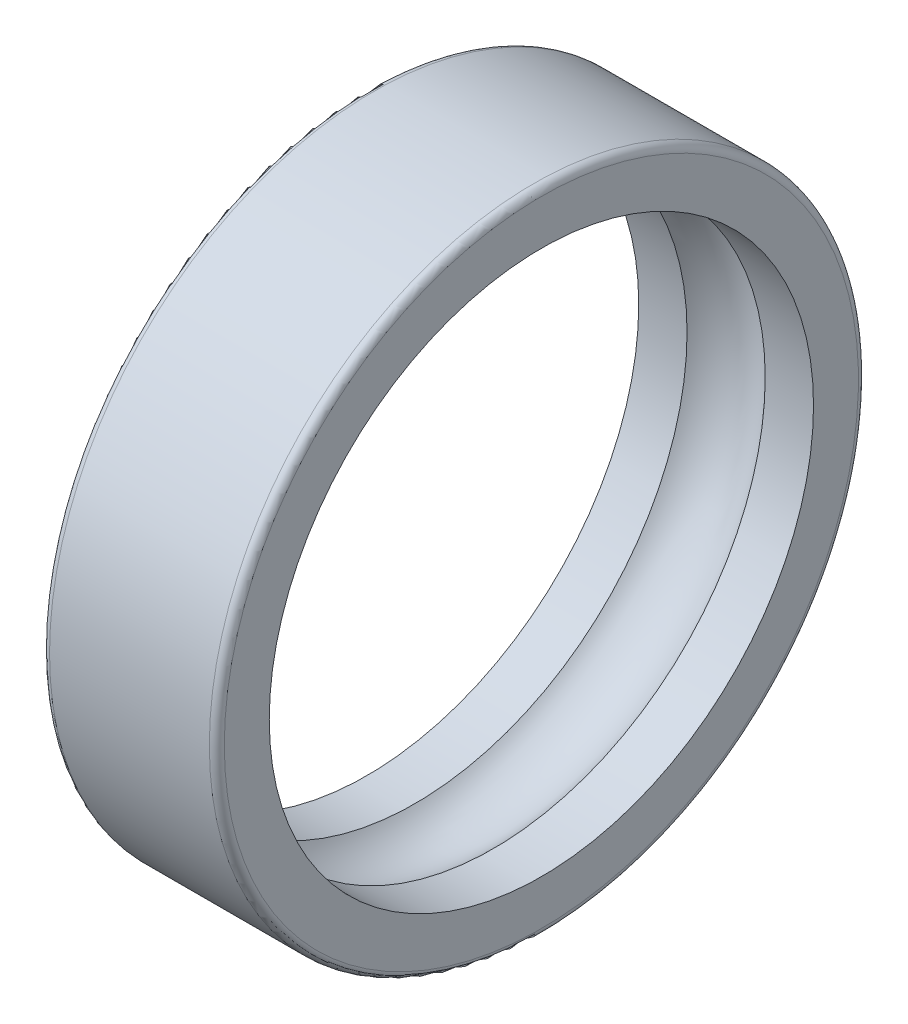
ISO-10303-21;
HEADER;
FILE_DESCRIPTION(('STEP AP214'),'2;1');
FILE_NAME('part.step','',(''),(''),'','','');
FILE_SCHEMA(('AUTOMOTIVE_DESIGN { 1 0 10303 214 1 1 1 1 }'));
ENDSEC;
DATA;
#1=APPLICATION_CONTEXT('core data for automotive mechanical design processes');
#2=APPLICATION_PROTOCOL_DEFINITION('international standard','automotive_design',2000,#1);
#3=PRODUCT_CONTEXT('',#1,'mechanical');
#4=PRODUCT('Part','Part','',(#3));
#5=PRODUCT_RELATED_PRODUCT_CATEGORY('part','',(#4));
#6=PRODUCT_DEFINITION_FORMATION('','',#4);
#7=PRODUCT_DEFINITION_CONTEXT('part definition',#1,'design');
#8=PRODUCT_DEFINITION('design','',#6,#7);
#9=PRODUCT_DEFINITION_SHAPE('','',#8);
#10=(LENGTH_UNIT() NAMED_UNIT(*) SI_UNIT(.MILLI.,.METRE.));
#11=(NAMED_UNIT(*) PLANE_ANGLE_UNIT() SI_UNIT($,.RADIAN.));
#12=(NAMED_UNIT(*) SI_UNIT($,.STERADIAN.) SOLID_ANGLE_UNIT());
#13=UNCERTAINTY_MEASURE_WITH_UNIT(LENGTH_MEASURE(1.E-05),#10,'distance_accuracy_value','');
#14=(GEOMETRIC_REPRESENTATION_CONTEXT(3) GLOBAL_UNCERTAINTY_ASSIGNED_CONTEXT((#13)) GLOBAL_UNIT_ASSIGNED_CONTEXT((#10,
#11,#12)) REPRESENTATION_CONTEXT('',''));
#15=CARTESIAN_POINT('',(0.,0.,0.));
#16=DIRECTION('',(0.,0.,1.));
#17=DIRECTION('',(1.,0.,0.));
#18=AXIS2_PLACEMENT_3D('',#15,#16,#17);
#19=CARTESIAN_POINT('',(0.150000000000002,0.,0.));
#20=DIRECTION('',(-1.,0.,0.));
#21=DIRECTION('',(0.,0.,1.));
#22=AXIS2_PLACEMENT_3D('',#19,#20,#21);
#23=TOROIDAL_SURFACE('',#22,6.35,0.149999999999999);
#24=CARTESIAN_POINT('',(0.,0.,0.));
#25=DIRECTION('',(-1.,0.,0.));
#26=DIRECTION('',(0.,0.,1.));
#27=AXIS2_PLACEMENT_3D('',#24,#25,#26);
#28=CIRCLE('',#27,6.35);
#29=CARTESIAN_POINT('',(0.,0.,6.35));
#30=VERTEX_POINT('',#29);
#31=EDGE_CURVE('E10',#30,#30,#28,.T.);
#32=ORIENTED_EDGE('',*,*,#31,.F.);
#33=EDGE_LOOP('',(#32));
#34=FACE_BOUND('',#33,.T.);
#35=CARTESIAN_POINT('',(0.150000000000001,0.,0.));
#36=DIRECTION('',(-1.,0.,0.));
#37=DIRECTION('',(0.,0.,1.));
#38=AXIS2_PLACEMENT_3D('',#35,#36,#37);
#39=CIRCLE('',#38,6.5);
#40=CARTESIAN_POINT('',(0.150000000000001,0.,6.5));
#41=VERTEX_POINT('',#40);
#42=EDGE_CURVE('E388',#41,#41,#39,.T.);
#43=ORIENTED_EDGE('',*,*,#42,.T.);
#44=EDGE_LOOP('',(#43));
#45=FACE_BOUND('',#44,.T.);
#46=ADVANCED_FACE('F360',(#34,#45),#23,.T.);
#47=CARTESIAN_POINT('',(0.,0.,-6.35));
#48=DIRECTION('',(1.,0.,0.));
#49=DIRECTION('',(0.,0.,-1.));
#50=AXIS2_PLACEMENT_3D('',#47,#48,#49);
#51=PLANE('',#50);
#52=CARTESIAN_POINT('',(0.,0.,0.));
#53=DIRECTION('',(-1.,0.,0.));
#54=DIRECTION('',(0.,0.,1.));
#55=AXIS2_PLACEMENT_3D('',#52,#53,#54);
#56=CIRCLE('',#55,5.45);
#57=CARTESIAN_POINT('',(0.,0.,5.45));
#58=VERTEX_POINT('',#57);
#59=EDGE_CURVE('E366',#58,#58,#56,.T.);
#60=ORIENTED_EDGE('',*,*,#59,.F.);
#61=EDGE_LOOP('',(#60));
#62=FACE_BOUND('',#61,.T.);
#63=ORIENTED_EDGE('',*,*,#31,.T.);
#64=EDGE_LOOP('',(#63));
#65=FACE_BOUND('',#64,.T.);
#66=ADVANCED_FACE('F425',(#62,#65),#51,.F.);
#67=CARTESIAN_POINT('',(0.,0.,0.));
#68=DIRECTION('',(-1.,0.,0.));
#69=DIRECTION('',(0.,0.,1.));
#70=AXIS2_PLACEMENT_3D('',#67,#68,#69);
#71=CYLINDRICAL_SURFACE('',#70,5.45);
#72=CARTESIAN_POINT('',(0.967376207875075,0.,0.));
#73=DIRECTION('',(-1.,0.,0.));
#74=DIRECTION('',(0.,0.,1.));
#75=AXIS2_PLACEMENT_3D('',#72,#73,#74);
#76=CIRCLE('',#75,5.45);
#77=CARTESIAN_POINT('',(0.967376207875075,0.,5.45));
#78=VERTEX_POINT('',#77);
#79=EDGE_CURVE('E370',#78,#78,#76,.T.);
#80=ORIENTED_EDGE('',*,*,#79,.F.);
#81=EDGE_LOOP('',(#80));
#82=FACE_BOUND('',#81,.T.);
#83=ORIENTED_EDGE('',*,*,#59,.T.);
#84=EDGE_LOOP('',(#83));
#85=FACE_BOUND('',#84,.T.);
#86=ADVANCED_FACE('F420',(#82,#85),#71,.F.);
#87=CARTESIAN_POINT('',(1.75,0.,0.));
#88=DIRECTION('',(-1.,0.,0.));
#89=DIRECTION('',(0.,0.,1.));
#90=AXIS2_PLACEMENT_3D('',#87,#88,#89);
#91=TOROIDAL_SURFACE('',#90,4.75,1.05);
#92=CARTESIAN_POINT('',(2.53262379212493,0.,0.));
#93=DIRECTION('',(-1.,0.,0.));
#94=DIRECTION('',(0.,0.,1.));
#95=AXIS2_PLACEMENT_3D('',#92,#93,#94);
#96=CIRCLE('',#95,5.45);
#97=CARTESIAN_POINT('',(2.53262379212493,0.,5.45));
#98=VERTEX_POINT('',#97);
#99=EDGE_CURVE('E374',#98,#98,#96,.T.);
#100=ORIENTED_EDGE('',*,*,#99,.F.);
#101=EDGE_LOOP('',(#100));
#102=FACE_BOUND('',#101,.T.);
#103=ORIENTED_EDGE('',*,*,#79,.T.);
#104=EDGE_LOOP('',(#103));
#105=FACE_BOUND('',#104,.T.);
#106=ADVANCED_FACE('F414',(#102,#105),#91,.F.);
#107=CARTESIAN_POINT('',(0.,0.,0.));
#108=DIRECTION('',(-1.,0.,0.));
#109=DIRECTION('',(0.,0.,1.));
#110=AXIS2_PLACEMENT_3D('',#107,#108,#109);
#111=CYLINDRICAL_SURFACE('',#110,5.45);
#112=CARTESIAN_POINT('',(3.5,0.,0.));
#113=DIRECTION('',(-1.,0.,0.));
#114=DIRECTION('',(0.,0.,1.));
#115=AXIS2_PLACEMENT_3D('',#112,#113,#114);
#116=CIRCLE('',#115,5.45);
#117=CARTESIAN_POINT('',(3.5,0.,5.45));
#118=VERTEX_POINT('',#117);
#119=EDGE_CURVE('E379',#118,#118,#116,.T.);
#120=ORIENTED_EDGE('',*,*,#119,.F.);
#121=EDGE_LOOP('',(#120));
#122=FACE_BOUND('',#121,.T.);
#123=ORIENTED_EDGE('',*,*,#99,.T.);
#124=EDGE_LOOP('',(#123));
#125=FACE_BOUND('',#124,.T.);
#126=ADVANCED_FACE('F408',(#122,#125),#111,.F.);
#127=CARTESIAN_POINT('',(3.5,0.,-6.35));
#128=DIRECTION('',(-1.,0.,0.));
#129=DIRECTION('',(0.,0.,1.));
#130=AXIS2_PLACEMENT_3D('',#127,#128,#129);
#131=PLANE('',#130);
#132=CARTESIAN_POINT('',(3.5,0.,0.));
#133=DIRECTION('',(-1.,0.,0.));
#134=DIRECTION('',(0.,0.,1.));
#135=AXIS2_PLACEMENT_3D('',#132,#133,#134);
#136=CIRCLE('',#135,6.35);
#137=CARTESIAN_POINT('',(3.5,0.,6.35));
#138=VERTEX_POINT('',#137);
#139=EDGE_CURVE('E382',#138,#138,#136,.T.);
#140=ORIENTED_EDGE('',*,*,#139,.F.);
#141=EDGE_LOOP('',(#140));
#142=FACE_BOUND('',#141,.T.);
#143=ORIENTED_EDGE('',*,*,#119,.T.);
#144=EDGE_LOOP('',(#143));
#145=FACE_BOUND('',#144,.T.);
#146=ADVANCED_FACE('F402',(#142,#145),#131,.F.);
#147=CARTESIAN_POINT('',(3.35,0.,0.));
#148=DIRECTION('',(-1.,0.,0.));
#149=DIRECTION('',(0.,0.,1.));
#150=AXIS2_PLACEMENT_3D('',#147,#148,#149);
#151=TOROIDAL_SURFACE('',#150,6.35,0.15);
#152=CARTESIAN_POINT('',(3.35,0.,0.));
#153=DIRECTION('',(-1.,0.,0.));
#154=DIRECTION('',(0.,0.,1.));
#155=AXIS2_PLACEMENT_3D('',#152,#153,#154);
#156=CIRCLE('',#155,6.5);
#157=CARTESIAN_POINT('',(3.35,0.,6.5));
#158=VERTEX_POINT('',#157);
#159=EDGE_CURVE('E385',#158,#158,#156,.T.);
#160=ORIENTED_EDGE('',*,*,#159,.F.);
#161=EDGE_LOOP('',(#160));
#162=FACE_BOUND('',#161,.T.);
#163=ORIENTED_EDGE('',*,*,#139,.T.);
#164=EDGE_LOOP('',(#163));
#165=FACE_BOUND('',#164,.T.);
#166=ADVANCED_FACE('F396',(#162,#165),#151,.T.);
#167=CARTESIAN_POINT('',(0.,0.,0.));
#168=DIRECTION('',(-1.,0.,0.));
#169=DIRECTION('',(0.,0.,1.));
#170=AXIS2_PLACEMENT_3D('',#167,#168,#169);
#171=CYLINDRICAL_SURFACE('',#170,6.5);
#172=ORIENTED_EDGE('',*,*,#42,.F.);
#173=EDGE_LOOP('',(#172));
#174=FACE_BOUND('',#173,.T.);
#175=ORIENTED_EDGE('',*,*,#159,.T.);
#176=EDGE_LOOP('',(#175));
#177=FACE_BOUND('',#176,.T.);
#178=ADVANCED_FACE('F393',(#174,#177),#171,.T.);
#179=CLOSED_SHELL('',(#46,#66,#86,#106,#126,#146,#166,#178));
#180=MANIFOLD_SOLID_BREP('B2',#179);
#181=ADVANCED_BREP_SHAPE_REPRESENTATION('',(#18,#180),#14);
#182=SHAPE_DEFINITION_REPRESENTATION(#9,#181);
ENDSEC;
END-ISO-10303-21;
